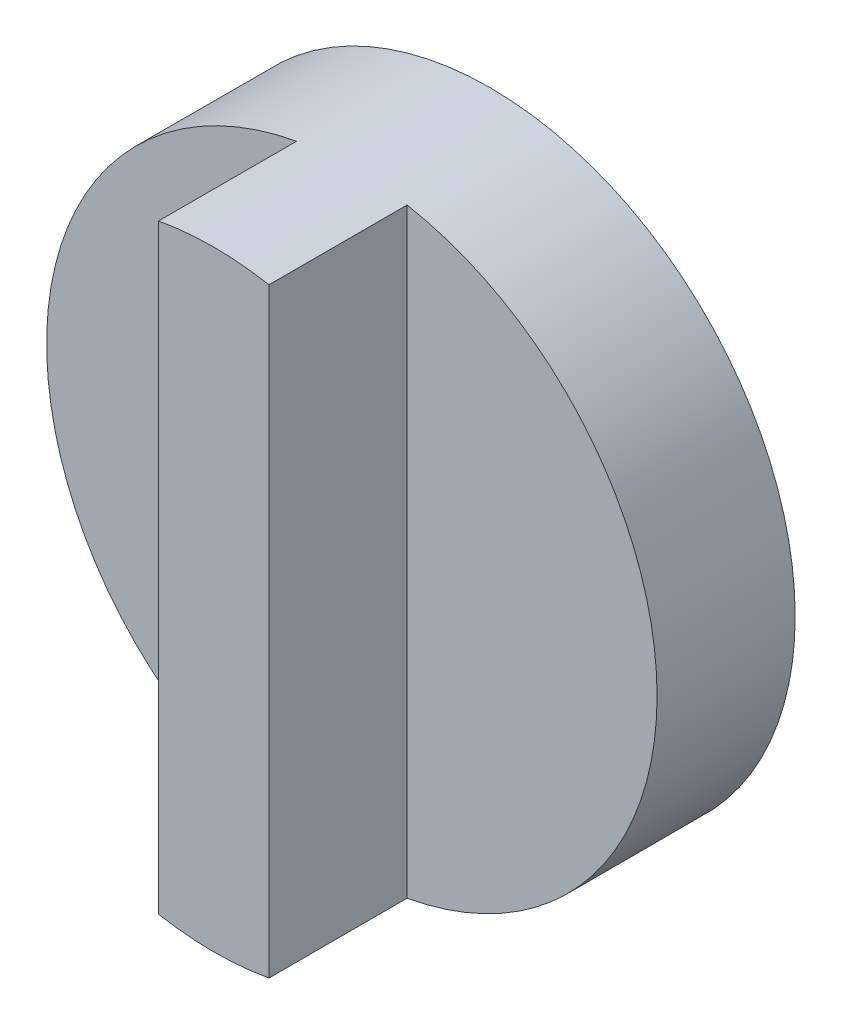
ISO-10303-21;
HEADER;
FILE_DESCRIPTION(('STEP AP214'),'2;1');
FILE_NAME('part.step','',(''),(''),'','','');
FILE_SCHEMA(('AUTOMOTIVE_DESIGN { 1 0 10303 214 1 1 1 1 }'));
ENDSEC;
DATA;
#1=APPLICATION_CONTEXT('core data for automotive mechanical design processes');
#2=APPLICATION_PROTOCOL_DEFINITION('international standard','automotive_design',2000,#1);
#3=PRODUCT_CONTEXT('',#1,'mechanical');
#4=PRODUCT('Part','Part','',(#3));
#5=PRODUCT_RELATED_PRODUCT_CATEGORY('part','',(#4));
#6=PRODUCT_DEFINITION_FORMATION('','',#4);
#7=PRODUCT_DEFINITION_CONTEXT('part definition',#1,'design');
#8=PRODUCT_DEFINITION('design','',#6,#7);
#9=PRODUCT_DEFINITION_SHAPE('','',#8);
#10=(LENGTH_UNIT() NAMED_UNIT(*) SI_UNIT(.MILLI.,.METRE.));
#11=(NAMED_UNIT(*) PLANE_ANGLE_UNIT() SI_UNIT($,.RADIAN.));
#12=(NAMED_UNIT(*) SI_UNIT($,.STERADIAN.) SOLID_ANGLE_UNIT());
#13=UNCERTAINTY_MEASURE_WITH_UNIT(LENGTH_MEASURE(1.E-05),#10,'distance_accuracy_value','');
#14=(GEOMETRIC_REPRESENTATION_CONTEXT(3) GLOBAL_UNCERTAINTY_ASSIGNED_CONTEXT((#13)) GLOBAL_UNIT_ASSIGNED_CONTEXT((#10,
#11,#12)) REPRESENTATION_CONTEXT('',''));
#15=CARTESIAN_POINT('',(0.,0.,0.));
#16=DIRECTION('',(0.,0.,1.));
#17=DIRECTION('',(1.,0.,0.));
#18=AXIS2_PLACEMENT_3D('',#15,#16,#17);
#19=CARTESIAN_POINT('',(0.,0.,8.));
#20=DIRECTION('',(0.,0.,1.));
#21=DIRECTION('',(1.,0.,0.));
#22=AXIS2_PLACEMENT_3D('',#19,#20,#21);
#23=PLANE('',#22);
#24=CARTESIAN_POINT('',(0.,0.,8.));
#25=DIRECTION('',(0.,0.,1.));
#26=DIRECTION('',(1.,0.,0.));
#27=AXIS2_PLACEMENT_3D('',#24,#25,#26);
#28=CIRCLE('',#27,6.75);
#29=CARTESIAN_POINT('',(-6.75,0.,8.));
#30=VERTEX_POINT('',#29);
#31=EDGE_CURVE('E18',#30,#30,#28,.F.);
#32=ORIENTED_EDGE('',*,*,#31,.T.);
#33=EDGE_LOOP('',(#32));
#34=FACE_BOUND('',#33,.T.);
#35=ADVANCED_FACE('F15',(#34),#23,.F.);
#36=CARTESIAN_POINT('',(0.,0.,0.));
#37=DIRECTION('',(0.,0.,1.));
#38=DIRECTION('',(1.,0.,0.));
#39=AXIS2_PLACEMENT_3D('',#36,#37,#38);
#40=CYLINDRICAL_SURFACE('',#39,6.75);
#41=CARTESIAN_POINT('',(0.,0.,0.));
#42=DIRECTION('',(0.,0.,1.));
#43=DIRECTION('',(1.,0.,0.));
#44=AXIS2_PLACEMENT_3D('',#41,#42,#43);
#45=CIRCLE('',#44,6.75);
#46=CARTESIAN_POINT('',(-6.75,0.,0.));
#47=VERTEX_POINT('',#46);
#48=EDGE_CURVE('E33',#47,#47,#45,.T.);
#49=ORIENTED_EDGE('',*,*,#48,.F.);
#50=EDGE_LOOP('',(#49));
#51=FACE_BOUND('',#50,.T.);
#52=ORIENTED_EDGE('',*,*,#31,.F.);
#53=EDGE_LOOP('',(#52));
#54=FACE_BOUND('',#53,.T.);
#55=ADVANCED_FACE('F127',(#51,#54),#40,.F.);
#56=CARTESIAN_POINT('',(-13.05,-0.901042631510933,10.));
#57=DIRECTION('',(0.,0.,1.));
#58=DIRECTION('',(1.,0.,0.));
#59=AXIS2_PLACEMENT_3D('',#56,#57,#58);
#60=PLANE('',#59);
#61=CARTESIAN_POINT('',(0.,0.,10.));
#62=DIRECTION('',(0.,0.,1.));
#63=DIRECTION('',(1.,0.,0.));
#64=AXIS2_PLACEMENT_3D('',#61,#62,#63);
#65=CIRCLE('',#64,22.1);
#66=CARTESIAN_POINT('',(-4.00000000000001,-21.7349948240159,10.));
#67=VERTEX_POINT('',#66);
#68=CARTESIAN_POINT('',(-4.,21.734994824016,10.));
#69=VERTEX_POINT('',#68);
#70=EDGE_CURVE('E93',#67,#69,#65,.F.);
#71=ORIENTED_EDGE('',*,*,#70,.F.);
#72=DIRECTION('',(0.,1.,0.));
#73=VECTOR('',#72,1.);
#74=CARTESIAN_POINT('',(-4.,-31.8545071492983,10.));
#75=LINE('',#74,#73);
#76=EDGE_CURVE('E91',#67,#69,#75,.T.);
#77=ORIENTED_EDGE('',*,*,#76,.T.);
#78=EDGE_LOOP('',(#71,#77));
#79=FACE_BOUND('',#78,.T.);
#80=ADVANCED_FACE('F124',(#79),#60,.T.);
#81=CARTESIAN_POINT('',(-4.,-31.8545071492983,20.));
#82=DIRECTION('',(1.,0.,0.));
#83=DIRECTION('',(0.,0.,-1.));
#84=AXIS2_PLACEMENT_3D('',#81,#82,#83);
#85=PLANE('',#84);
#86=ORIENTED_EDGE('',*,*,#76,.F.);
#87=DIRECTION('',(0.,0.,1.));
#88=VECTOR('',#87,1.);
#89=CARTESIAN_POINT('',(-4.00000000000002,-21.7349948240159,0.));
#90=LINE('',#89,#88);
#91=CARTESIAN_POINT('',(-4.00000000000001,-21.7349948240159,20.));
#92=VERTEX_POINT('',#91);
#93=EDGE_CURVE('E95',#92,#67,#90,.F.);
#94=ORIENTED_EDGE('',*,*,#93,.F.);
#95=DIRECTION('',(0.,1.,0.));
#96=VECTOR('',#95,1.);
#97=CARTESIAN_POINT('',(-4.,0.,20.));
#98=LINE('',#97,#96);
#99=CARTESIAN_POINT('',(-4.,21.734994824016,20.));
#100=VERTEX_POINT('',#99);
#101=EDGE_CURVE('E89',#92,#100,#98,.T.);
#102=ORIENTED_EDGE('',*,*,#101,.T.);
#103=DIRECTION('',(0.,0.,1.));
#104=VECTOR('',#103,1.);
#105=CARTESIAN_POINT('',(-4.,21.734994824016,0.));
#106=LINE('',#105,#104);
#107=EDGE_CURVE('E83',#69,#100,#106,.T.);
#108=ORIENTED_EDGE('',*,*,#107,.F.);
#109=EDGE_LOOP('',(#86,#94,#102,#108));
#110=FACE_BOUND('',#109,.T.);
#111=ADVANCED_FACE('F120',(#110),#85,.F.);
#112=CARTESIAN_POINT('',(0.,0.,20.));
#113=DIRECTION('',(0.,0.,-1.));
#114=DIRECTION('',(-1.,0.,0.));
#115=AXIS2_PLACEMENT_3D('',#112,#113,#114);
#116=PLANE('',#115);
#117=CARTESIAN_POINT('',(0.,0.,20.));
#118=DIRECTION('',(0.,0.,1.));
#119=DIRECTION('',(1.,0.,0.));
#120=AXIS2_PLACEMENT_3D('',#117,#118,#119);
#121=CIRCLE('',#120,22.1);
#122=CARTESIAN_POINT('',(4.,21.734994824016,20.));
#123=VERTEX_POINT('',#122);
#124=EDGE_CURVE('E81',#100,#123,#121,.F.);
#125=ORIENTED_EDGE('',*,*,#124,.F.);
#126=ORIENTED_EDGE('',*,*,#101,.F.);
#127=CARTESIAN_POINT('',(0.,0.,20.));
#128=DIRECTION('',(0.,0.,1.));
#129=DIRECTION('',(1.,0.,0.));
#130=AXIS2_PLACEMENT_3D('',#127,#128,#129);
#131=CIRCLE('',#130,22.1);
#132=CARTESIAN_POINT('',(3.99999999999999,-21.734994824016,20.));
#133=VERTEX_POINT('',#132);
#134=EDGE_CURVE('E87',#133,#92,#131,.F.);
#135=ORIENTED_EDGE('',*,*,#134,.F.);
#136=DIRECTION('',(0.,1.,0.));
#137=VECTOR('',#136,1.);
#138=CARTESIAN_POINT('',(4.,31.8545071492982,20.));
#139=LINE('',#138,#137);
#140=EDGE_CURVE('E73',#133,#123,#139,.T.);
#141=ORIENTED_EDGE('',*,*,#140,.T.);
#142=EDGE_LOOP('',(#125,#126,#135,#141));
#143=FACE_BOUND('',#142,.T.);
#144=ADVANCED_FACE('F117',(#143),#116,.F.);
#145=CARTESIAN_POINT('',(4.,31.8545071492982,20.));
#146=DIRECTION('',(-1.,0.,0.));
#147=DIRECTION('',(0.,0.,1.));
#148=AXIS2_PLACEMENT_3D('',#145,#146,#147);
#149=PLANE('',#148);
#150=DIRECTION('',(0.,1.,0.));
#151=VECTOR('',#150,1.);
#152=CARTESIAN_POINT('',(4.,1.59007523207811,10.));
#153=LINE('',#152,#151);
#154=CARTESIAN_POINT('',(4.,21.734994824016,10.));
#155=VERTEX_POINT('',#154);
#156=CARTESIAN_POINT('',(3.99999999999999,-21.734994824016,10.));
#157=VERTEX_POINT('',#156);
#158=EDGE_CURVE('E63',#155,#157,#153,.F.);
#159=ORIENTED_EDGE('',*,*,#158,.F.);
#160=DIRECTION('',(0.,0.,1.));
#161=VECTOR('',#160,1.);
#162=CARTESIAN_POINT('',(4.,21.734994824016,0.));
#163=LINE('',#162,#161);
#164=EDGE_CURVE('E67',#123,#155,#163,.F.);
#165=ORIENTED_EDGE('',*,*,#164,.F.);
#166=ORIENTED_EDGE('',*,*,#140,.F.);
#167=DIRECTION('',(0.,0.,1.));
#168=VECTOR('',#167,1.);
#169=CARTESIAN_POINT('',(3.99999999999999,-21.734994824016,0.));
#170=LINE('',#169,#168);
#171=EDGE_CURVE('E70',#157,#133,#170,.T.);
#172=ORIENTED_EDGE('',*,*,#171,.F.);
#173=EDGE_LOOP('',(#159,#165,#166,#172));
#174=FACE_BOUND('',#173,.T.);
#175=ADVANCED_FACE('F65',(#174),#149,.F.);
#176=CARTESIAN_POINT('',(13.05,1.59007523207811,10.));
#177=DIRECTION('',(0.,0.,1.));
#178=DIRECTION('',(1.,0.,0.));
#179=AXIS2_PLACEMENT_3D('',#176,#177,#178);
#180=PLANE('',#179);
#181=CARTESIAN_POINT('',(0.,0.,10.));
#182=DIRECTION('',(0.,0.,1.));
#183=DIRECTION('',(1.,0.,0.));
#184=AXIS2_PLACEMENT_3D('',#181,#182,#183);
#185=CIRCLE('',#184,22.1);
#186=EDGE_CURVE('E23',#155,#157,#185,.F.);
#187=ORIENTED_EDGE('',*,*,#186,.F.);
#188=ORIENTED_EDGE('',*,*,#158,.T.);
#189=EDGE_LOOP('',(#187,#188));
#190=FACE_BOUND('',#189,.T.);
#191=ADVANCED_FACE('F75',(#190),#180,.T.);
#192=CARTESIAN_POINT('',(0.,0.,0.));
#193=DIRECTION('',(0.,0.,-1.));
#194=DIRECTION('',(-1.,0.,0.));
#195=AXIS2_PLACEMENT_3D('',#192,#193,#194);
#196=PLANE('',#195);
#197=ORIENTED_EDGE('',*,*,#48,.T.);
#198=EDGE_LOOP('',(#197));
#199=FACE_BOUND('',#198,.T.);
#200=CARTESIAN_POINT('',(0.,0.,0.));
#201=DIRECTION('',(0.,0.,1.));
#202=DIRECTION('',(1.,0.,0.));
#203=AXIS2_PLACEMENT_3D('',#200,#201,#202);
#204=CIRCLE('',#203,22.1);
#205=CARTESIAN_POINT('',(22.1,0.,0.));
#206=VERTEX_POINT('',#205);
#207=EDGE_CURVE('E9',#206,#206,#204,.T.);
#208=ORIENTED_EDGE('',*,*,#207,.F.);
#209=EDGE_LOOP('',(#208));
#210=FACE_BOUND('',#209,.T.);
#211=ADVANCED_FACE('F102',(#199,#210),#196,.T.);
#212=CARTESIAN_POINT('',(0.,0.,0.));
#213=DIRECTION('',(0.,0.,1.));
#214=DIRECTION('',(1.,0.,0.));
#215=AXIS2_PLACEMENT_3D('',#212,#213,#214);
#216=CYLINDRICAL_SURFACE('',#215,22.1);
#217=ORIENTED_EDGE('',*,*,#207,.T.);
#218=EDGE_LOOP('',(#217));
#219=FACE_BOUND('',#218,.T.);
#220=ORIENTED_EDGE('',*,*,#164,.T.);
#221=ORIENTED_EDGE('',*,*,#186,.T.);
#222=ORIENTED_EDGE('',*,*,#171,.T.);
#223=ORIENTED_EDGE('',*,*,#134,.T.);
#224=ORIENTED_EDGE('',*,*,#93,.T.);
#225=ORIENTED_EDGE('',*,*,#70,.T.);
#226=ORIENTED_EDGE('',*,*,#107,.T.);
#227=ORIENTED_EDGE('',*,*,#124,.T.);
#228=EDGE_LOOP('',(#220,#221,#222,#223,#224,#225,#226,#227));
#229=FACE_BOUND('',#228,.T.);
#230=ADVANCED_FACE('F78',(#219,#229),#216,.T.);
#231=CLOSED_SHELL('',(#35,#55,#80,#111,#144,#175,#191,#211,#230));
#232=MANIFOLD_SOLID_BREP('B1',#231);
#233=ADVANCED_BREP_SHAPE_REPRESENTATION('',(#18,#232),#14);
#234=SHAPE_DEFINITION_REPRESENTATION(#9,#233);
ENDSEC;
END-ISO-10303-21;
